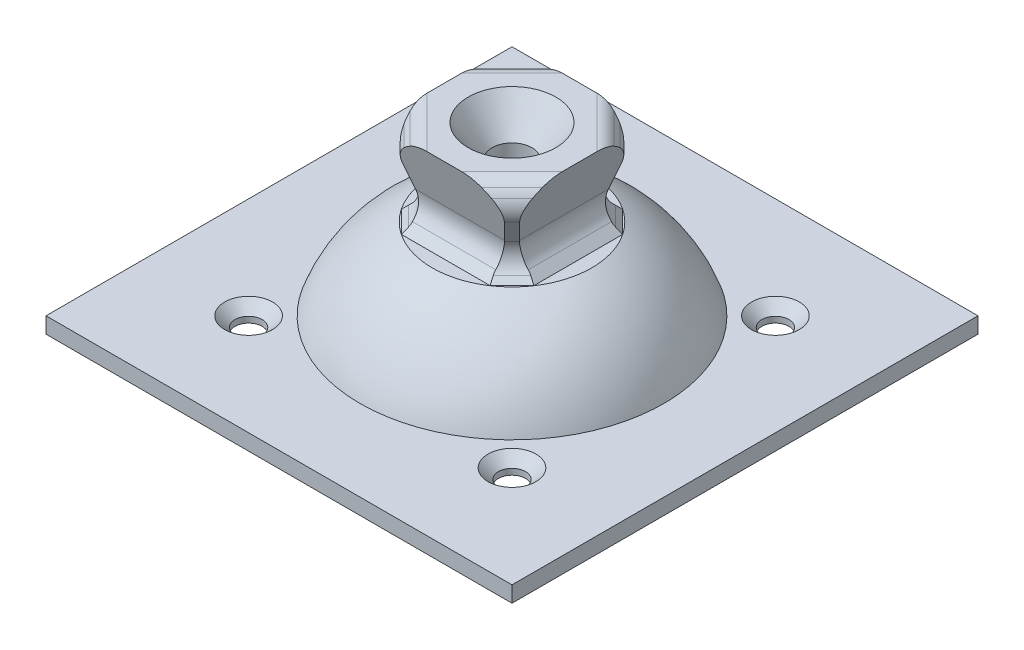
from build123d import *

# Parameters (mm, degrees)
SKETCH4_W                                    = 17
SKETCH4_H                                    = 11
BOSS_EXTRUDE2_DEPTH                          = 8.5
CUT_EXTRUDE1_DEPTH                           = 13.5
CUT_EXTRUDE2_DEPTH                           = 13.5
CUT_EXTRUDE3_DEPTH                           = 13.5
CUT_EXTRUDE4_DEPTH                           = 13.5
FILLET1_R                                    = 2
SKETCH17_W                                   = 58.42
SKETCH17_H                                   = 58.42
BOSS_EXTRUDE3_DEPTH                          = 2
CSK_FOR_M3_CROSS_COUNTERSUNK_HEAD_SC_2_COUNT = 2
CSK_FOR_M3_CROSS_COUNTERSUNK_HEAD_SC_2_PITCH = 33.02
CSK_FOR_M3_CROSS_COUNTERSUNK_HEAD_SC_3_COUNT = 2
CSK_FOR_M3_CROSS_COUNTERSUNK_HEAD_SC_3_PITCH = 46.69733183
CSK_FOR_M3_CROSS_COUNTERSUNK_HEAD_SC_4_COUNT = 2
CSK_FOR_M3_CROSS_COUNTERSUNK_HEAD_SC_4_PITCH = 33.02


with BuildPart() as part:
    # Sketch4 → Boss-Extrude2 (new, symmetric)
    with BuildSketch(Plane.XY):
        Rectangle(SKETCH4_W, SKETCH4_H)
    extrude(amount=BOSS_EXTRUDE2_DEPTH, both=True)

    # Sketch5 → Cut-Extrude1 (cut, symmetric)
    with BuildSketch(Plane(origin=(0, 0, 0), x_dir=(0, 0, -1), z_dir=(1, 0, 0))):
        with BuildLine():
            Line((8.5, 5.5), (6.502509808, -1.291466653))
            ThreePointArc((6.502509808, -1.291466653), (6.473626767, -2.879228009), (7.259285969, -4.259285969))
            Line((7.259285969, -4.259285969), (8.5, -5.5))
            Line((8.5, -5.5), (8.5, 5.5))
        make_face()
        with BuildLine():
            Line((-8.5, -5.5), (-7.259285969, -4.259285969))
            ThreePointArc((-7.259285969, -4.259285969), (-6.473626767, -2.879228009), (-6.502509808, -1.291466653))
            Line((-6.502509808, -1.291466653), (-8.5, 5.5))
            Line((-8.5, 5.5), (-8.5, -5.5))
        make_face()
    extrude(amount=CUT_EXTRUDE1_DEPTH, both=True, mode=Mode.SUBTRACT)

    # Sketch7 → Cut-Extrude2 (cut, symmetric)
    with BuildSketch(Plane.XY):
        with BuildLine():
            Line((8.5, 5.5), (6.502538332, -1.291517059))
            ThreePointArc((6.502538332, -1.291517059), (6.473662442, -2.879270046), (7.259319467, -4.259319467))
            Line((7.259319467, -4.259319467), (8.5, -5.5))
            Line((8.5, -5.5), (8.5, 5.5))
        make_face()
        with BuildLine():
            Line((-8.5, -5.5), (-7.259319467, -4.259319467))
            ThreePointArc((-7.259319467, -4.259319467), (-6.473662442, -2.879270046), (-6.502538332, -1.291517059))
            Line((-6.502538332, -1.291517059), (-8.5, 5.5))
            Line((-8.5, 5.5), (-8.5, -5.5))
        make_face()
    extrude(amount=CUT_EXTRUDE2_DEPTH, both=True, mode=Mode.SUBTRACT)

    # Sketch11 → Cut-Extrude3 (cut, symmetric)
    with BuildSketch(Plane(origin=(0, 0, 0), x_dir=(0.7071067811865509, 0, -0.7071067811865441), z_dir=(0.7071067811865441, 0, 0.7071067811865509))):
        with BuildLine():
            Line((10, -5.5), (9.159523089, -4.659523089))
            ThreePointArc((9.159523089, -4.659523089), (8.341069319, -3.136306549), (8.499291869, -1.414382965))
            Line((8.499291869, -1.414382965), (9.693462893, 1.541294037))
            ThreePointArc((9.693462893, 1.541294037), (9.908907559, 2.799328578), (9.581873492, 4.033069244))
            ThreePointArc((9.581873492, 4.033069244), (9.013209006, 4.854851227), (8.25, 5.5))
            Line((8.25, 5.5), (14, 5.5))
            Line((14, 5.5), (14, -5.5))
            Line((14, -5.5), (10, -5.5))
        make_face()
        with BuildLine():
            Line((-14, 5.5), (-8.25, 5.5))
            ThreePointArc((-8.25, 5.5), (-9.013209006, 4.854851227), (-9.581873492, 4.033069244))
            ThreePointArc((-9.581873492, 4.033069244), (-9.908907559, 2.799328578), (-9.693462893, 1.541294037))
            Line((-9.693462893, 1.541294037), (-8.499291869, -1.414382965))
            ThreePointArc((-8.499291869, -1.414382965), (-8.341069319, -3.136306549), (-9.159523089, -4.659523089))
            Line((-9.159523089, -4.659523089), (-10, -5.5))
            Line((-10, -5.5), (-14, -5.5))
            Line((-14, -5.5), (-14, 5.5))
        make_face()
    extrude(amount=CUT_EXTRUDE3_DEPTH, both=True, mode=Mode.SUBTRACT)

    # Sketch12 → Cut-Extrude4 (cut, symmetric)
    with BuildSketch(Plane(origin=(0, 0, 0), x_dir=(-0.7071067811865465, 0, -0.7071067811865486), z_dir=(0.7071067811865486, 0, -0.7071067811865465))):
        with BuildLine():
            Line((10, -5.5), (9.159523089, -4.659523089))
            ThreePointArc((9.159523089, -4.659523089), (8.341069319, -3.136306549), (8.499291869, -1.414382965))
            Line((8.499291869, -1.414382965), (9.693462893, 1.541294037))
            ThreePointArc((9.693462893, 1.541294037), (9.908907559, 2.799328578), (9.581873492, 4.033069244))
            ThreePointArc((9.581873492, 4.033069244), (9.013209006, 4.854851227), (8.25, 5.5))
            Line((8.25, 5.5), (14, 5.5))
            Line((14, 5.5), (14, -5.5))
            Line((14, -5.5), (10, -5.5))
        make_face()
        with BuildLine():
            Line((-14, 5.5), (-8.25, 5.5))
            ThreePointArc((-8.25, 5.5), (-9.013209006, 4.854851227), (-9.581873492, 4.033069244))
            ThreePointArc((-9.581873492, 4.033069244), (-9.908907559, 2.799328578), (-9.693462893, 1.541294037))
            Line((-9.693462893, 1.541294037), (-8.499291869, -1.414382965))
            ThreePointArc((-8.499291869, -1.414382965), (-8.341069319, -3.136306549), (-9.159523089, -4.659523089))
            Line((-9.159523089, -4.659523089), (-10, -5.5))
            Line((-10, -5.5), (-14, -5.5))
            Line((-14, -5.5), (-14, 5.5))
        make_face()
    extrude(amount=CUT_EXTRUDE4_DEPTH, both=True, mode=Mode.SUBTRACT)

    # Sketch14 → Cut-Revolve1 (revolve, cut)
    with BuildSketch(Plane.XY, mode=Mode.PRIVATE) as cut_revolve1_sk:
        Polygon((0, 5.5), (5.5, 5.5), (2.5, 1.5), (2.5, -5.5), (0, -5.5), align=None)
    revolve(cut_revolve1_sk.sketch.rotate(Axis((0, -5.5, 0), (0, 1, 0)), 90), axis=Axis((0, -5.5, 0), (0, 1, 0)), mode=Mode.SUBTRACT)

    # Fillet1
    fillet1_edges = [part.edges().sort_by_distance(p)[0] for p in [
        (5.833630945, 5.5, -5.833630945),
        (-5.833630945, 5.5, -5.833630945),
        (-5.833630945, 5.5, 5.833630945),
        (5.833630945, 5.5, 5.833630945),
    ]]
    fillet(fillet1_edges, radius=FILLET1_R)

    # Sketch15 → Revolve1 (revolve)
    with BuildSketch(Plane(origin=(0, 0, 0), x_dir=(0, 0, -1), z_dir=(1, 0, 0))):
        with BuildLine():
            Line((0, -15.5), (19.05, -15.5))
            ThreePointArc((19.05, -15.5), (15.527372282, -9.509556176), (9.9979998, -5.3))
            Line((9.9979998, -5.3), (0, -5.3))
            Line((0, -5.3), (0, -5.5))
            Line((0, -5.5), (0, -15.5))
        make_face()
    revolve(axis=Axis((0, -5.5, 0), (0, -1, 0)))

    # Sketch17 → Boss-Extrude3 (add)
    with BuildSketch(Plane(origin=(0, -15.5, 0), x_dir=(-1, 0, 0), z_dir=(0, -1, 0))):
        Rectangle(SKETCH17_W, SKETCH17_H)
    extrude(amount=BOSS_EXTRUDE3_DEPTH)

    # Sketch22 → CSK for M3 Cross Countersunk Head Screw1 (revolve, cut)
    with BuildSketch(Plane(origin=(16.51, -15.5, 16.51), x_dir=(0, 0, 1), z_dir=(1, 0, 0))):
        Polygon((0, 0), (0, 2), (1.7, 2), (1.7, 1.255395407), (3, 0), align=None)
    csk_for_m3_cross_countersunk_head_screw1 = revolve(axis=Axis((16.51, -9.15, 16.51), (0, -1, 0)), mode=Mode.SUBTRACT)

    # CSK for M3 Cross Countersunk Head Sc 2: CSK for M3 Cross Countersunk Head Screw1 ×2
    with Locations(*[(0, 0, -i * CSK_FOR_M3_CROSS_COUNTERSUNK_HEAD_SC_2_PITCH) for i in range(1, CSK_FOR_M3_CROSS_COUNTERSUNK_HEAD_SC_2_COUNT)]):
        add(csk_for_m3_cross_countersunk_head_screw1, mode=Mode.SUBTRACT)

    # CSK for M3 Cross Countersunk Head Sc 3: CSK for M3 Cross Countersunk Head Screw1 ×2
    with Locations(*[Vector(-0.7071067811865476, 0, -0.7071067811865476) * (i * CSK_FOR_M3_CROSS_COUNTERSUNK_HEAD_SC_3_PITCH) for i in range(1, CSK_FOR_M3_CROSS_COUNTERSUNK_HEAD_SC_3_COUNT)]):
        add(csk_for_m3_cross_countersunk_head_screw1, mode=Mode.SUBTRACT)

    # CSK for M3 Cross Countersunk Head Sc 4: CSK for M3 Cross Countersunk Head Screw1 ×2
    with Locations(*[(-i * CSK_FOR_M3_CROSS_COUNTERSUNK_HEAD_SC_4_PITCH, 0, 0) for i in range(1, CSK_FOR_M3_CROSS_COUNTERSUNK_HEAD_SC_4_COUNT)]):
        add(csk_for_m3_cross_countersunk_head_screw1, mode=Mode.SUBTRACT)


solid = part.part
